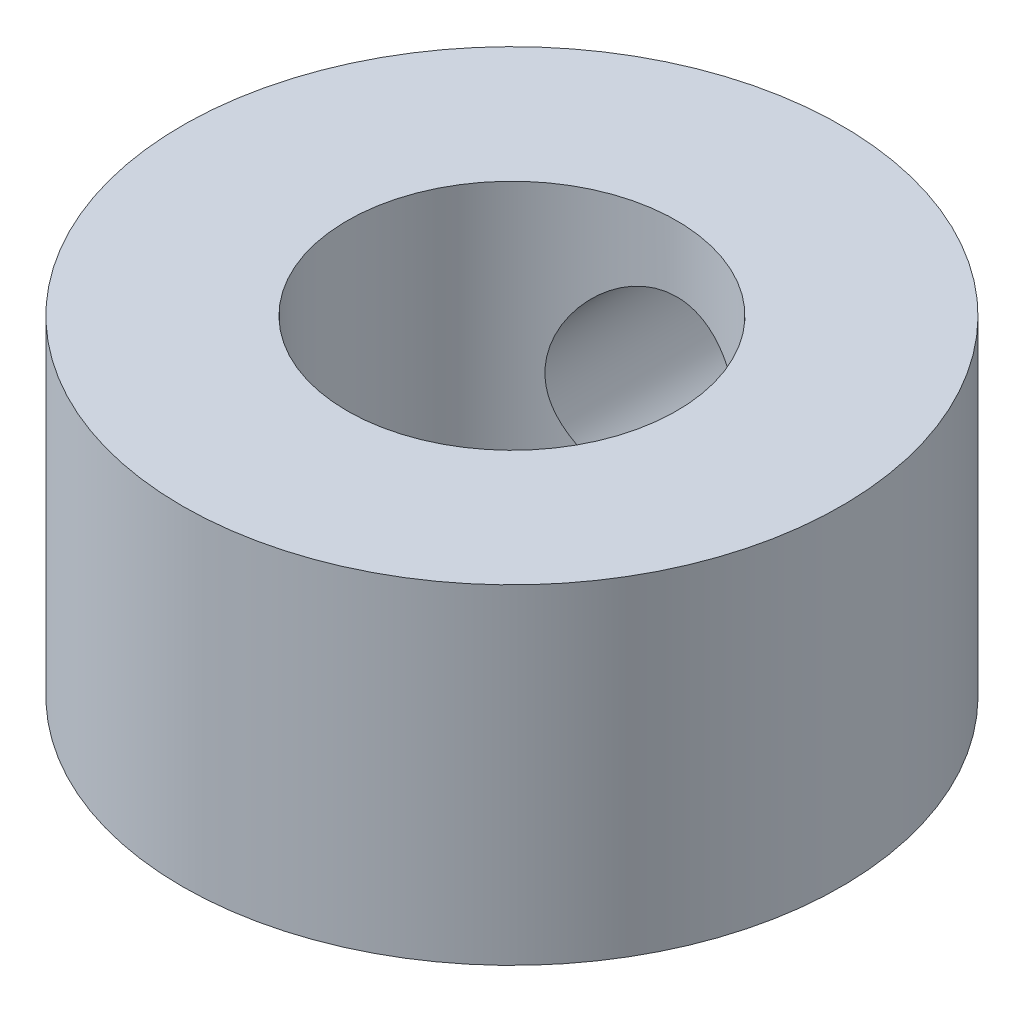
ISO-10303-21;
HEADER;
FILE_DESCRIPTION(('STEP AP214'),'2;1');
FILE_NAME('part.step','',(''),(''),'','','');
FILE_SCHEMA(('AUTOMOTIVE_DESIGN { 1 0 10303 214 1 1 1 1 }'));
ENDSEC;
DATA;
#1=APPLICATION_CONTEXT('core data for automotive mechanical design processes');
#2=APPLICATION_PROTOCOL_DEFINITION('international standard','automotive_design',2000,#1);
#3=PRODUCT_CONTEXT('',#1,'mechanical');
#4=PRODUCT('Part','Part','',(#3));
#5=PRODUCT_RELATED_PRODUCT_CATEGORY('part','',(#4));
#6=PRODUCT_DEFINITION_FORMATION('','',#4);
#7=PRODUCT_DEFINITION_CONTEXT('part definition',#1,'design');
#8=PRODUCT_DEFINITION('design','',#6,#7);
#9=PRODUCT_DEFINITION_SHAPE('','',#8);
#10=(LENGTH_UNIT() NAMED_UNIT(*) SI_UNIT(.MILLI.,.METRE.));
#11=(NAMED_UNIT(*) PLANE_ANGLE_UNIT() SI_UNIT($,.RADIAN.));
#12=(NAMED_UNIT(*) SI_UNIT($,.STERADIAN.) SOLID_ANGLE_UNIT());
#13=UNCERTAINTY_MEASURE_WITH_UNIT(LENGTH_MEASURE(1.E-05),#10,'distance_accuracy_value','');
#14=(GEOMETRIC_REPRESENTATION_CONTEXT(3) GLOBAL_UNCERTAINTY_ASSIGNED_CONTEXT((#13)) GLOBAL_UNIT_ASSIGNED_CONTEXT((#10,
#11,#12)) REPRESENTATION_CONTEXT('',''));
#15=CARTESIAN_POINT('',(0.,0.,0.));
#16=DIRECTION('',(0.,0.,1.));
#17=DIRECTION('',(1.,0.,0.));
#18=AXIS2_PLACEMENT_3D('',#15,#16,#17);
#19=CARTESIAN_POINT('',(0.,5.,0.));
#20=DIRECTION('',(0.,1.,0.));
#21=DIRECTION('',(0.,0.,1.));
#22=AXIS2_PLACEMENT_3D('',#19,#20,#21);
#23=PLANE('',#22);
#24=CARTESIAN_POINT('',(0.,5.,0.));
#25=DIRECTION('',(0.,1.,0.));
#26=DIRECTION('',(0.,0.,1.));
#27=AXIS2_PLACEMENT_3D('',#24,#25,#26);
#28=CIRCLE('',#27,5.);
#29=CARTESIAN_POINT('',(0.,5.,5.));
#30=VERTEX_POINT('',#29);
#31=EDGE_CURVE('E10',#30,#30,#28,.T.);
#32=ORIENTED_EDGE('',*,*,#31,.T.);
#33=EDGE_LOOP('',(#32));
#34=FACE_BOUND('',#33,.T.);
#35=CARTESIAN_POINT('',(0.,5.,0.));
#36=DIRECTION('',(0.,1.,0.));
#37=DIRECTION('',(0.,0.,1.));
#38=AXIS2_PLACEMENT_3D('',#35,#36,#37);
#39=CIRCLE('',#38,2.5);
#40=CARTESIAN_POINT('',(0.,5.,2.5));
#41=VERTEX_POINT('',#40);
#42=EDGE_CURVE('E48',#41,#41,#39,.T.);
#43=ORIENTED_EDGE('',*,*,#42,.F.);
#44=EDGE_LOOP('',(#43));
#45=FACE_BOUND('',#44,.T.);
#46=ADVANCED_FACE('F30',(#34,#45),#23,.T.);
#47=CARTESIAN_POINT('',(0.,0.,0.));
#48=DIRECTION('',(0.,1.,0.));
#49=DIRECTION('',(0.,0.,1.));
#50=AXIS2_PLACEMENT_3D('',#47,#48,#49);
#51=PLANE('',#50);
#52=CARTESIAN_POINT('',(0.,0.,0.));
#53=DIRECTION('',(0.,1.,0.));
#54=DIRECTION('',(0.,0.,1.));
#55=AXIS2_PLACEMENT_3D('',#52,#53,#54);
#56=CIRCLE('',#55,5.);
#57=CARTESIAN_POINT('',(0.,0.,5.));
#58=VERTEX_POINT('',#57);
#59=EDGE_CURVE('E43',#58,#58,#56,.T.);
#60=ORIENTED_EDGE('',*,*,#59,.F.);
#61=EDGE_LOOP('',(#60));
#62=FACE_BOUND('',#61,.T.);
#63=CARTESIAN_POINT('',(0.,0.,0.));
#64=DIRECTION('',(0.,1.,0.));
#65=DIRECTION('',(0.,0.,1.));
#66=AXIS2_PLACEMENT_3D('',#63,#64,#65);
#67=CIRCLE('',#66,2.5);
#68=CARTESIAN_POINT('',(0.,0.,2.5));
#69=VERTEX_POINT('',#68);
#70=EDGE_CURVE('E50',#69,#69,#67,.T.);
#71=ORIENTED_EDGE('',*,*,#70,.T.);
#72=EDGE_LOOP('',(#71));
#73=FACE_BOUND('',#72,.T.);
#74=ADVANCED_FACE('F70',(#62,#73),#51,.F.);
#75=CARTESIAN_POINT('',(0.,5.,0.));
#76=DIRECTION('',(0.,-1.,0.));
#77=DIRECTION('',(0.,0.,-1.));
#78=AXIS2_PLACEMENT_3D('',#75,#76,#77);
#79=CYLINDRICAL_SURFACE('',#78,5.);
#80=CARTESIAN_POINT('',(0.,4.,-5.));
#81=CARTESIAN_POINT('',(-0.0822886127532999,3.99999900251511,-4.9999992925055));
#82=CARTESIAN_POINT('',(-0.164587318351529,3.99320613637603,-4.99794915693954));
#83=CARTESIAN_POINT('',(-0.326788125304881,3.9662786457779,-4.98997105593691));
#84=CARTESIAN_POINT('',(-0.40668950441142,3.94614004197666,-4.98404193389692));
#85=CARTESIAN_POINT('',(-0.561732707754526,3.89325398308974,-4.96895552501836));
#86=CARTESIAN_POINT('',(-0.636881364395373,3.86052513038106,-4.95980300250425));
#87=CARTESIAN_POINT('',(-0.780624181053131,3.78346390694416,-4.93922109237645));
#88=CARTESIAN_POINT('',(-0.849217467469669,3.73912999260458,-4.92779140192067));
#89=CARTESIAN_POINT('',(-0.979871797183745,3.63877599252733,-4.90350737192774));
#90=CARTESIAN_POINT('',(-1.04171807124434,3.58248337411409,-4.89062383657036));
#91=CARTESIAN_POINT('',(-1.15524920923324,3.46039077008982,-4.86505834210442));
#92=CARTESIAN_POINT('',(-1.20693236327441,3.39458918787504,-4.85237641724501));
#93=CARTESIAN_POINT('',(-1.29980037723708,3.25352924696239,-4.82834113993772));
#94=CARTESIAN_POINT('',(-1.34072309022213,3.17809153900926,-4.81702406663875));
#95=CARTESIAN_POINT('',(-1.4092139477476,3.02101074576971,-4.79743620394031));
#96=CARTESIAN_POINT('',(-1.43678529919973,2.93936915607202,-4.78916468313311));
#97=CARTESIAN_POINT('',(-1.47701633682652,2.77460973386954,-4.77690870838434));
#98=CARTESIAN_POINT('',(-1.49007196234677,2.69159725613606,-4.77281069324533));
#99=CARTESIAN_POINT('',(-1.50213730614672,2.52446684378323,-4.76902789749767));
#100=CARTESIAN_POINT('',(-1.50115042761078,2.44034918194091,-4.76934204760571));
#101=CARTESIAN_POINT('',(-1.48546977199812,2.27661609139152,-4.77424744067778));
#102=CARTESIAN_POINT('',(-1.47127205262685,2.19694774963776,-4.7786838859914));
#103=CARTESIAN_POINT('',(-1.43037420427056,2.04118021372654,-4.79108356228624));
#104=CARTESIAN_POINT('',(-1.40367284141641,1.96508137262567,-4.79904714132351));
#105=CARTESIAN_POINT('',(-1.33816026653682,1.81739965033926,-4.81772733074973));
#106=CARTESIAN_POINT('',(-1.29918816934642,1.74589291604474,-4.82848016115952));
#107=CARTESIAN_POINT('',(-1.21035222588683,1.61026797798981,-4.85150987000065));
#108=CARTESIAN_POINT('',(-1.16048574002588,1.54615157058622,-4.86378711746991));
#109=CARTESIAN_POINT('',(-1.04881290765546,1.42431380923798,-4.88911011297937));
#110=CARTESIAN_POINT('',(-0.986594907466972,1.36697133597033,-4.90216654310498));
#111=CARTESIAN_POINT('',(-0.853263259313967,1.26344601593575,-4.92712244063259));
#112=CARTESIAN_POINT('',(-0.782149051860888,1.21726387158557,-4.9390218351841));
#113=CARTESIAN_POINT('',(-0.632355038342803,1.13714007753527,-4.9604316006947));
#114=CARTESIAN_POINT('',(-0.55362774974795,1.10328248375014,-4.96992543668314));
#115=CARTESIAN_POINT('',(-0.391245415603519,1.04940040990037,-4.98533521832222));
#116=CARTESIAN_POINT('',(-0.307591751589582,1.02937207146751,-4.99125216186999));
#117=CARTESIAN_POINT('',(-0.140952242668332,1.00434782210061,-4.99868364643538));
#118=CARTESIAN_POINT('',(-0.0580500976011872,0.99883841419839,-5.0003485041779));
#119=CARTESIAN_POINT('',(0.107499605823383,1.00156915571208,-4.9995292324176));
#120=CARTESIAN_POINT('',(0.19014719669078,1.00980746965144,-4.99704565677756));
#121=CARTESIAN_POINT('',(0.350903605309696,1.0393846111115,-4.98830696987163));
#122=CARTESIAN_POINT('',(0.429072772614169,1.06042338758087,-4.98213829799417));
#123=CARTESIAN_POINT('',(0.580754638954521,1.1146432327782,-4.96674347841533));
#124=CARTESIAN_POINT('',(0.654266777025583,1.14782576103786,-4.95751696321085));
#125=CARTESIAN_POINT('',(0.796437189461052,1.22625316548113,-4.93669654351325));
#126=CARTESIAN_POINT('',(0.864943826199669,1.27175934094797,-4.92505280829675));
#127=CARTESIAN_POINT('',(0.993523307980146,1.37322475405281,-4.90073468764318));
#128=CARTESIAN_POINT('',(1.05359403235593,1.42918661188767,-4.8880600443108));
#129=CARTESIAN_POINT('',(1.16585744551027,1.55238730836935,-4.86253171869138));
#130=CARTESIAN_POINT('',(1.21768481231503,1.61996187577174,-4.84968825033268));
#131=CARTESIAN_POINT('',(1.30928995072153,1.76312793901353,-4.82576515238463));
#132=CARTESIAN_POINT('',(1.34906803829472,1.83871922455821,-4.81468547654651));
#133=CARTESIAN_POINT('',(1.41517347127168,1.99553249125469,-4.79567189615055));
#134=CARTESIAN_POINT('',(1.4415634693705,2.07672618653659,-4.78772337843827));
#135=CARTESIAN_POINT('',(1.48021730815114,2.24268796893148,-4.77591594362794));
#136=CARTESIAN_POINT('',(1.49248598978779,2.32745482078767,-4.772055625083));
#137=CARTESIAN_POINT('',(1.50221984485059,2.49436151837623,-4.76899972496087));
#138=CARTESIAN_POINT('',(1.5002805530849,2.57646365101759,-4.76961647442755));
#139=CARTESIAN_POINT('',(1.48307505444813,2.7391141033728,-4.77499401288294));
#140=CARTESIAN_POINT('',(1.46780938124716,2.81966248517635,-4.77975463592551));
#141=CARTESIAN_POINT('',(1.42476888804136,2.97594539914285,-4.79275763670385));
#142=CARTESIAN_POINT('',(1.39715175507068,3.05172728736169,-4.80095604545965));
#143=CARTESIAN_POINT('',(1.33031507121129,3.19764243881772,-4.81990278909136));
#144=CARTESIAN_POINT('',(1.29109329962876,3.26777461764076,-4.83065161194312));
#145=CARTESIAN_POINT('',(1.20048763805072,3.40316311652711,-4.85397676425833));
#146=CARTESIAN_POINT('',(1.14871276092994,3.46814876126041,-4.86660540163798));
#147=CARTESIAN_POINT('',(1.03517434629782,3.58870249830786,-4.89201320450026));
#148=CARTESIAN_POINT('',(0.973408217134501,3.64426813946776,-4.90479240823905));
#149=CARTESIAN_POINT('',(0.839465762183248,3.74602341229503,-4.92950936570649));
#150=CARTESIAN_POINT('',(0.767037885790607,3.79189144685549,-4.94141159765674));
#151=CARTESIAN_POINT('',(0.615141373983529,3.87073516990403,-4.96260680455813));
#152=CARTESIAN_POINT('',(0.535676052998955,3.90371688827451,-4.97190099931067));
#153=CARTESIAN_POINT('',(0.380757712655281,3.95289527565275,-4.98602174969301));
#154=CARTESIAN_POINT('',(0.305786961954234,3.97051167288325,-4.99122027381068));
#155=CARTESIAN_POINT('',(0.153880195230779,3.99406352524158,-4.99820944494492));
#156=CARTESIAN_POINT('',(0.0769445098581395,4.00000093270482,-5.0000006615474));
#157=CARTESIAN_POINT('',(0.,4.,-5.));
#158=B_SPLINE_CURVE_WITH_KNOTS('',3,(#80,#81,#82,#83,#84,#85,#86,#87,#88,#89,#90,#91,#92,#93,
#94,#95,#96,#97,#98,#99,#100,#101,#102,#103,#104,#105,#106,#107,#108,#109,#110,#111,#112,#113,
#114,#115,#116,#117,#118,#119,#120,#121,#122,#123,#124,#125,#126,#127,#128,#129,#130,#131,#132,
#133,#134,#135,#136,#137,#138,#139,#140,#141,#142,#143,#144,#145,#146,#147,#148,#149,#150,#151,
#152,#153,#154,#155,#156,#157),.UNSPECIFIED.,.T.,.F.,(4,2,2,2,2,2,2,2,2,2,2,2,2,2,2,2,2,2,2,2,2,
2,2,2,2,2,2,2,2,2,2,2,2,2,2,2,2,2,4),(0.,0.246583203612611,0.493239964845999,0.739533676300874,
0.985860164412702,1.23855602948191,1.49129437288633,1.74971481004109,2.00807314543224,
2.25919689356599,2.51025978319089,2.75226016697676,2.99428443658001,3.23962426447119,
3.48502360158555,3.74067104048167,3.99633456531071,4.25371046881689,4.51101453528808,
4.75908809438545,5.00712853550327,5.24956746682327,5.49203554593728,5.74011305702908,
5.98825282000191,6.24540400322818,6.5025484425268,6.75847814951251,7.01432009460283,
7.25950155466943,7.504673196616,7.74680040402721,7.98897397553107,8.2399692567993,
8.49102974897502,8.7494299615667,9.00770911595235,9.23831691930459,9.46888616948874),.UNSPECIFIED.);
#159=CARTESIAN_POINT('',(0.,4.,-5.));
#160=VERTEX_POINT('',#159);
#161=EDGE_CURVE('E53',#160,#160,#158,.T.);
#162=ORIENTED_EDGE('',*,*,#161,.T.);
#163=EDGE_LOOP('',(#162));
#164=FACE_BOUND('',#163,.T.);
#165=ORIENTED_EDGE('',*,*,#31,.F.);
#166=EDGE_LOOP('',(#165));
#167=FACE_BOUND('',#166,.T.);
#168=ORIENTED_EDGE('',*,*,#59,.T.);
#169=EDGE_LOOP('',(#168));
#170=FACE_BOUND('',#169,.T.);
#171=ADVANCED_FACE('F32',(#164,#167,#170),#79,.T.);
#172=CARTESIAN_POINT('',(0.,5.,0.));
#173=DIRECTION('',(0.,-1.,0.));
#174=DIRECTION('',(0.,0.,-1.));
#175=AXIS2_PLACEMENT_3D('',#172,#173,#174);
#176=CYLINDRICAL_SURFACE('',#175,2.5);
#177=CARTESIAN_POINT('',(0.,4.,-2.5));
#178=CARTESIAN_POINT('',(-0.0767298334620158,3.99999590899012,-2.49999625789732));
#179=CARTESIAN_POINT('',(-0.153582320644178,3.99407132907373,-2.4964290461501));
#180=CARTESIAN_POINT('',(-0.304975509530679,3.97067568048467,-2.48249903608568));
#181=CARTESIAN_POINT('',(-0.379510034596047,3.95317613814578,-2.47211948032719));
#182=CARTESIAN_POINT('',(-0.523751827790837,3.90761363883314,-2.44561558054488));
#183=CARTESIAN_POINT('',(-0.593481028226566,3.87960304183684,-2.42951973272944));
#184=CARTESIAN_POINT('',(-0.727030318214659,3.81413966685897,-2.39295367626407));
#185=CARTESIAN_POINT('',(-0.790851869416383,3.77668923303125,-2.37248455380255));
#186=CARTESIAN_POINT('',(-0.916299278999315,3.69022517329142,-2.32705360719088));
#187=CARTESIAN_POINT('',(-0.977384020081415,3.64054630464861,-2.30186792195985));
#188=CARTESIAN_POINT('',(-1.09088270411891,3.53253279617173,-2.25030439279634));
#189=CARTESIAN_POINT('',(-1.14328534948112,3.47418706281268,-2.22392505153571));
#190=CARTESIAN_POINT('',(-1.24444996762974,3.34207648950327,-2.1691106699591));
#191=CARTESIAN_POINT('',(-1.29197766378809,3.26729822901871,-2.14082017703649));
#192=CARTESIAN_POINT('',(-1.37361437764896,3.10915342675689,-2.08938301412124));
#193=CARTESIAN_POINT('',(-1.4077451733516,3.02580110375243,-2.06622802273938));
#194=CARTESIAN_POINT('',(-1.45440601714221,2.87340354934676,-2.0335462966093));
#195=CARTESIAN_POINT('',(-1.47016197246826,2.80576400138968,-2.02207883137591));
#196=CARTESIAN_POINT('',(-1.49216172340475,2.66819628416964,-2.00590308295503));
#197=CARTESIAN_POINT('',(-1.49841734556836,2.59827107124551,-2.00118639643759));
#198=CARTESIAN_POINT('',(-1.50105508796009,2.45798850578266,-1.99920922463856));
#199=CARTESIAN_POINT('',(-1.49741783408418,2.3876305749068,-2.00196337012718));
#200=CARTESIAN_POINT('',(-1.48046060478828,2.24872122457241,-2.01453261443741));
#201=CARTESIAN_POINT('',(-1.46713334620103,2.18017120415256,-2.02435302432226));
#202=CARTESIAN_POINT('',(-1.43173921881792,2.04746975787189,-2.04953186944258));
#203=CARTESIAN_POINT('',(-1.40978748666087,1.98327294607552,-2.06481711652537));
#204=CARTESIAN_POINT('',(-1.35795061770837,1.85930500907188,-2.09927051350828));
#205=CARTESIAN_POINT('',(-1.32806257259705,1.79953551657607,-2.11844008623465));
#206=CARTESIAN_POINT('',(-1.25517983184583,1.6750159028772,-2.16255327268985));
#207=CARTESIAN_POINT('',(-1.21080724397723,1.61122190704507,-2.18792043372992));
#208=CARTESIAN_POINT('',(-1.11291092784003,1.49132351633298,-2.23930599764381));
#209=CARTESIAN_POINT('',(-1.05937845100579,1.43522656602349,-2.26532500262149));
#210=CARTESIAN_POINT('',(-0.935811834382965,1.32438701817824,-2.31935504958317));
#211=CARTESIAN_POINT('',(-0.864517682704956,1.27092269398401,-2.34713836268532));
#212=CARTESIAN_POINT('',(-0.712276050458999,1.17687795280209,-2.39772428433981));
#213=CARTESIAN_POINT('',(-0.631333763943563,1.13629064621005,-2.42052955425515));
#214=CARTESIAN_POINT('',(-0.467197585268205,1.0720678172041,-2.45730392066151));
#215=CARTESIAN_POINT('',(-0.384467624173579,1.04752464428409,-2.47173957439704));
#216=CARTESIAN_POINT('',(-0.215047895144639,1.01298880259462,-2.49218842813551));
#217=CARTESIAN_POINT('',(-0.128363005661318,1.00297868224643,-2.49821172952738));
#218=CARTESIAN_POINT('',(0.0337146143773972,0.99849215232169,-2.5009057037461));
#219=CARTESIAN_POINT('',(0.109042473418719,1.00209114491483,-2.49873521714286));
#220=CARTESIAN_POINT('',(0.257829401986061,1.02042585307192,-2.48778712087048));
#221=CARTESIAN_POINT('',(0.331288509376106,1.03516134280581,-2.47900964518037));
#222=CARTESIAN_POINT('',(0.472574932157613,1.07454343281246,-2.4559479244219));
#223=CARTESIAN_POINT('',(0.540495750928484,1.09894034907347,-2.44180275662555));
#224=CARTESIAN_POINT('',(0.671265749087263,1.15667737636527,-2.40913880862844));
#225=CARTESIAN_POINT('',(0.734113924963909,1.19001925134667,-2.39061916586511));
#226=CARTESIAN_POINT('',(0.860006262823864,1.26855697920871,-2.3484549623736));
#227=CARTESIAN_POINT('',(0.922394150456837,1.31462382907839,-2.3244780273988));
#228=CARTESIAN_POINT('',(1.03902603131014,1.41539139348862,-2.27474265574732));
#229=CARTESIAN_POINT('',(1.09326040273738,1.47010215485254,-2.2489821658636));
#230=CARTESIAN_POINT('',(1.19931996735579,1.59491039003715,-2.19445423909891));
#231=CARTESIAN_POINT('',(1.24991019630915,1.6660838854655,-2.16573241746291));
#232=CARTESIAN_POINT('',(1.33845238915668,1.8172160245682,-2.1121618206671));
#233=CARTESIAN_POINT('',(1.37641766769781,1.89716529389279,-2.0873089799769));
#234=CARTESIAN_POINT('',(1.43142578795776,2.04624302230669,-2.04984909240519));
#235=CARTESIAN_POINT('',(1.4512162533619,2.11398031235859,-2.03575659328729));
#236=CARTESIAN_POINT('',(1.48113663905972,2.2525320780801,-2.01409605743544));
#237=CARTESIAN_POINT('',(1.49127995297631,2.32334214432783,-2.00651897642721));
#238=CARTESIAN_POINT('',(1.50134130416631,2.46637694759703,-1.99900446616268));
#239=CARTESIAN_POINT('',(1.50122089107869,2.53860599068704,-1.99909576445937));
#240=CARTESIAN_POINT('',(1.49066472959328,2.68189443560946,-2.0069771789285));
#241=CARTESIAN_POINT('',(1.48022337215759,2.7529531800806,-2.0147714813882));
#242=CARTESIAN_POINT('',(1.45040174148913,2.88848841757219,-2.0363318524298));
#243=CARTESIAN_POINT('',(1.43147636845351,2.95311709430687,-2.04979211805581));
#244=CARTESIAN_POINT('',(1.38563242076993,3.07833725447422,-2.08105501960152));
#245=CARTESIAN_POINT('',(1.35871083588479,3.13892720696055,-2.09885929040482));
#246=CARTESIAN_POINT('',(1.29289245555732,3.26431985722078,-2.14012990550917));
#247=CARTESIAN_POINT('',(1.25279167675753,3.32834110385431,-2.16404587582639));
#248=CARTESIAN_POINT('',(1.16375698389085,3.44938007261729,-2.21320127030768));
#249=CARTESIAN_POINT('',(1.11481579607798,3.50639196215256,-2.23844177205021));
#250=CARTESIAN_POINT('',(1.00009777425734,3.62135094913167,-2.29225690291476));
#251=CARTESIAN_POINT('',(0.932876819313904,3.67793107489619,-2.32070308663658));
#252=CARTESIAN_POINT('',(0.788462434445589,3.77909785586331,-2.37365428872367));
#253=CARTESIAN_POINT('',(0.71126544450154,3.82368021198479,-2.39815789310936));
#254=CARTESIAN_POINT('',(0.551125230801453,3.89778580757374,-2.43985578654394));
#255=CARTESIAN_POINT('',(0.468430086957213,3.92772806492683,-2.45725077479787));
#256=CARTESIAN_POINT('',(0.297973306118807,3.97272469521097,-2.48366273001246));
#257=CARTESIAN_POINT('',(0.210232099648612,3.98783516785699,-2.49271125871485));
#258=CARTESIAN_POINT('',(0.101558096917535,3.99669745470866,-2.49802001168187));
#259=CARTESIAN_POINT('',(0.0812762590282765,3.9979344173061,-2.49876114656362));
#260=CARTESIAN_POINT('',(0.0406658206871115,3.99958624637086,-2.49975164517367));
#261=CARTESIAN_POINT('',(0.020337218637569,4.0000010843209,-2.50000099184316));
#262=CARTESIAN_POINT('',(0.,4.,-2.5));
#263=B_SPLINE_CURVE_WITH_KNOTS('',3,(#177,#178,#179,#180,#181,#182,#183,#184,#185,#186,#187,
#188,#189,#190,#191,#192,#193,#194,#195,#196,#197,#198,#199,#200,#201,#202,#203,#204,#205,#206,
#207,#208,#209,#210,#211,#212,#213,#214,#215,#216,#217,#218,#219,#220,#221,#222,#223,#224,#225,
#226,#227,#228,#229,#230,#231,#232,#233,#234,#235,#236,#237,#238,#239,#240,#241,#242,#243,#244,
#245,#246,#247,#248,#249,#250,#251,#252,#253,#254,#255,#256,#257,#258,#259,#260,#261,#262),
.UNSPECIFIED.,.T.,.F.,(4,2,2,2,2,2,2,2,2,2,2,2,2,2,2,2,2,2,2,2,2,2,2,2,2,2,2,2,2,2,2,2,2,2,2,2,
2,2,2,2,2,2,4),(0.,0.230102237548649,0.460772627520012,0.690308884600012,0.919788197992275,
1.16681590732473,1.414162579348,1.69183813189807,1.96906040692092,2.17933829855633,
2.38935420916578,2.59978170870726,2.81036753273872,3.01823267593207,3.22617409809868,
3.47046995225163,3.71500044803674,3.99360957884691,4.27206939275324,4.53296790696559,
4.79355286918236,5.01875602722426,5.24395461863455,5.46367785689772,5.68344445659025,
5.92601365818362,6.16886690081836,6.44336762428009,6.71757792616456,6.93257787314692,
7.14727888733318,7.36278425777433,7.57840681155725,7.78364098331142,7.98895251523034,
8.22578610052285,8.46281544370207,8.73854311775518,9.01436946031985,9.28175654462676,
9.54812832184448,9.60911473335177,9.6701032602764),.UNSPECIFIED.);
#264=CARTESIAN_POINT('',(0.,4.,-2.5));
#265=VERTEX_POINT('',#264);
#266=EDGE_CURVE('E35',#265,#265,#263,.T.);
#267=ORIENTED_EDGE('',*,*,#266,.F.);
#268=EDGE_LOOP('',(#267));
#269=FACE_BOUND('',#268,.T.);
#270=ORIENTED_EDGE('',*,*,#42,.T.);
#271=EDGE_LOOP('',(#270));
#272=FACE_BOUND('',#271,.T.);
#273=ORIENTED_EDGE('',*,*,#70,.F.);
#274=EDGE_LOOP('',(#273));
#275=FACE_BOUND('',#274,.T.);
#276=ADVANCED_FACE('F62',(#269,#272,#275),#176,.F.);
#277=CARTESIAN_POINT('',(0.,2.5,-5.));
#278=DIRECTION('',(0.,0.,1.));
#279=DIRECTION('',(1.,0.,0.));
#280=AXIS2_PLACEMENT_3D('',#277,#278,#279);
#281=CYLINDRICAL_SURFACE('',#280,1.5);
#282=ORIENTED_EDGE('',*,*,#266,.T.);
#283=EDGE_LOOP('',(#282));
#284=FACE_BOUND('',#283,.T.);
#285=ORIENTED_EDGE('',*,*,#161,.F.);
#286=EDGE_LOOP('',(#285));
#287=FACE_BOUND('',#286,.T.);
#288=ADVANCED_FACE('F59',(#284,#287),#281,.F.);
#289=CLOSED_SHELL('',(#46,#74,#171,#276,#288));
#290=MANIFOLD_SOLID_BREP('B2',#289);
#291=ADVANCED_BREP_SHAPE_REPRESENTATION('',(#18,#290),#14);
#292=SHAPE_DEFINITION_REPRESENTATION(#9,#291);
ENDSEC;
END-ISO-10303-21;
